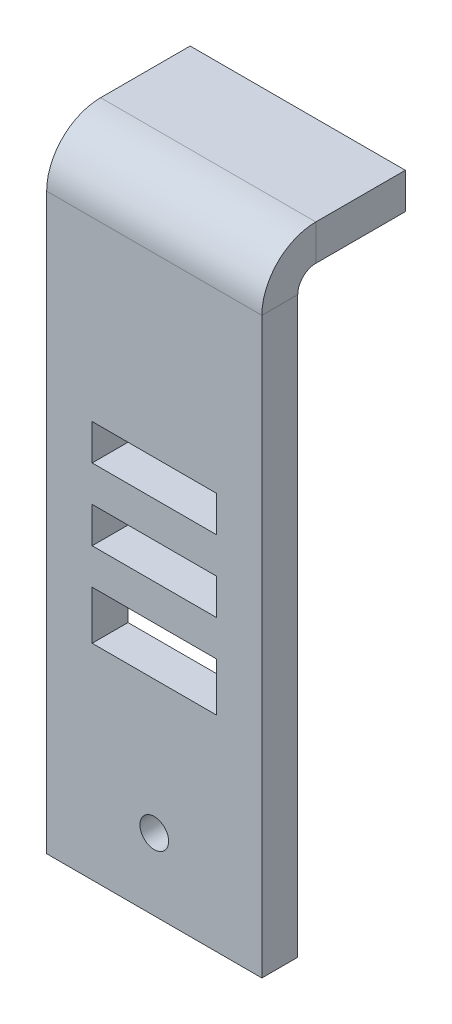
ISO-10303-21;
HEADER;
FILE_DESCRIPTION(('STEP AP214'),'2;1');
FILE_NAME('part.step','',(''),(''),'','','');
FILE_SCHEMA(('AUTOMOTIVE_DESIGN { 1 0 10303 214 1 1 1 1 }'));
ENDSEC;
DATA;
#1=APPLICATION_CONTEXT('core data for automotive mechanical design processes');
#2=APPLICATION_PROTOCOL_DEFINITION('international standard','automotive_design',2000,#1);
#3=PRODUCT_CONTEXT('',#1,'mechanical');
#4=PRODUCT('Part','Part','',(#3));
#5=PRODUCT_RELATED_PRODUCT_CATEGORY('part','',(#4));
#6=PRODUCT_DEFINITION_FORMATION('','',#4);
#7=PRODUCT_DEFINITION_CONTEXT('part definition',#1,'design');
#8=PRODUCT_DEFINITION('design','',#6,#7);
#9=PRODUCT_DEFINITION_SHAPE('','',#8);
#10=(LENGTH_UNIT() NAMED_UNIT(*) SI_UNIT(.MILLI.,.METRE.));
#11=(NAMED_UNIT(*) PLANE_ANGLE_UNIT() SI_UNIT($,.RADIAN.));
#12=(NAMED_UNIT(*) SI_UNIT($,.STERADIAN.) SOLID_ANGLE_UNIT());
#13=UNCERTAINTY_MEASURE_WITH_UNIT(LENGTH_MEASURE(1.E-05),#10,'distance_accuracy_value','');
#14=(GEOMETRIC_REPRESENTATION_CONTEXT(3) GLOBAL_UNCERTAINTY_ASSIGNED_CONTEXT((#13)) GLOBAL_UNIT_ASSIGNED_CONTEXT((#10,
#11,#12)) REPRESENTATION_CONTEXT('',''));
#15=CARTESIAN_POINT('',(0.,0.,0.));
#16=DIRECTION('',(0.,0.,1.));
#17=DIRECTION('',(1.,0.,0.));
#18=AXIS2_PLACEMENT_3D('',#15,#16,#17);
#19=CARTESIAN_POINT('',(8.45955391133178,22.143660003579,-3.175));
#20=DIRECTION('',(1.,0.,0.));
#21=DIRECTION('',(0.,1.,0.));
#22=AXIS2_PLACEMENT_3D('',#19,#20,#21);
#23=PLANE('',#22);
#24=DIRECTION('',(0.,1.,0.));
#25=VECTOR('',#24,1.);
#26=CARTESIAN_POINT('',(8.45955391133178,22.143660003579,-3.175));
#27=LINE('',#26,#25);
#28=CARTESIAN_POINT('',(8.45955391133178,-30.256539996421,-3.175));
#29=VERTEX_POINT('',#28);
#30=CARTESIAN_POINT('',(8.45955391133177,20.543460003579,-3.175));
#31=VERTEX_POINT('',#30);
#32=EDGE_CURVE('E335',#29,#31,#27,.T.);
#33=ORIENTED_EDGE('',*,*,#32,.T.);
#34=DIRECTION('',(0.,0.,1.));
#35=VECTOR('',#34,1.);
#36=CARTESIAN_POINT('',(8.45955391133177,20.543460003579,-3.175));
#37=LINE('',#36,#35);
#38=CARTESIAN_POINT('',(8.45955391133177,20.543460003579,0.));
#39=VERTEX_POINT('',#38);
#40=EDGE_CURVE('E313',#31,#39,#37,.T.);
#41=ORIENTED_EDGE('',*,*,#40,.T.);
#42=DIRECTION('',(0.,1.,0.));
#43=VECTOR('',#42,1.);
#44=CARTESIAN_POINT('',(8.45955391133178,22.143660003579,0.));
#45=LINE('',#44,#43);
#46=CARTESIAN_POINT('',(8.45955391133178,-30.256539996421,0.));
#47=VERTEX_POINT('',#46);
#48=EDGE_CURVE('E332',#47,#39,#45,.T.);
#49=ORIENTED_EDGE('',*,*,#48,.F.);
#50=DIRECTION('',(0.,0.,1.));
#51=VECTOR('',#50,1.);
#52=CARTESIAN_POINT('',(8.45955391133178,-30.256539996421,-3.175));
#53=LINE('',#52,#51);
#54=EDGE_CURVE('E11',#29,#47,#53,.T.);
#55=ORIENTED_EDGE('',*,*,#54,.F.);
#56=EDGE_LOOP('',(#33,#41,#49,#55));
#57=FACE_BOUND('',#56,.T.);
#58=ADVANCED_FACE('F32',(#57),#23,.T.);
#59=CARTESIAN_POINT('',(-10.5904460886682,-30.256539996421,-3.175));
#60=DIRECTION('',(0.,0.,1.));
#61=DIRECTION('',(1.,0.,0.));
#62=AXIS2_PLACEMENT_3D('',#59,#60,#61);
#63=PLANE('',#62);
#64=DIRECTION('',(-1.,0.,0.));
#65=VECTOR('',#64,1.);
#66=CARTESIAN_POINT('',(-10.5904460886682,4.89279983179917,-3.175));
#67=LINE('',#66,#65);
#68=CARTESIAN_POINT('',(4.433893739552,4.89279983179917,-3.175));
#69=VERTEX_POINT('',#68);
#70=CARTESIAN_POINT('',(-6.56478591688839,4.89279983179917,-3.175));
#71=VERTEX_POINT('',#70);
#72=EDGE_CURVE('E199',#69,#71,#67,.T.);
#73=ORIENTED_EDGE('',*,*,#72,.T.);
#74=DIRECTION('',(0.,-1.,0.));
#75=VECTOR('',#74,1.);
#76=CARTESIAN_POINT('',(-6.56478591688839,-30.256539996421,-3.175));
#77=LINE('',#76,#75);
#78=CARTESIAN_POINT('',(-6.56478591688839,1.71779983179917,-3.175));
#79=VERTEX_POINT('',#78);
#80=EDGE_CURVE('E202',#71,#79,#77,.T.);
#81=ORIENTED_EDGE('',*,*,#80,.T.);
#82=DIRECTION('',(1.,0.,0.));
#83=VECTOR('',#82,1.);
#84=CARTESIAN_POINT('',(-10.5904460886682,1.71779983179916,-3.175));
#85=LINE('',#84,#83);
#86=CARTESIAN_POINT('',(4.433893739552,1.71779983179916,-3.175));
#87=VERTEX_POINT('',#86);
#88=EDGE_CURVE('E194',#79,#87,#85,.T.);
#89=ORIENTED_EDGE('',*,*,#88,.T.);
#90=DIRECTION('',(0.,1.,0.));
#91=VECTOR('',#90,1.);
#92=CARTESIAN_POINT('',(4.433893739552,-30.256539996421,-3.175));
#93=LINE('',#92,#91);
#94=EDGE_CURVE('E174',#87,#69,#93,.T.);
#95=ORIENTED_EDGE('',*,*,#94,.T.);
#96=EDGE_LOOP('',(#73,#81,#89,#95));
#97=FACE_BOUND('',#96,.T.);
#98=DIRECTION('',(-1.,0.,0.));
#99=VECTOR('',#98,1.);
#100=CARTESIAN_POINT('',(-10.5904460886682,-1.45720016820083,-3.175));
#101=LINE('',#100,#99);
#102=CARTESIAN_POINT('',(4.433893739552,-1.45720016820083,-3.175));
#103=VERTEX_POINT('',#102);
#104=CARTESIAN_POINT('',(-6.56478591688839,-1.45720016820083,-3.175));
#105=VERTEX_POINT('',#104);
#106=EDGE_CURVE('E231',#103,#105,#101,.T.);
#107=ORIENTED_EDGE('',*,*,#106,.T.);
#108=DIRECTION('',(0.,-1.,0.));
#109=VECTOR('',#108,1.);
#110=CARTESIAN_POINT('',(-6.56478591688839,-30.256539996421,-3.175));
#111=LINE('',#110,#109);
#112=CARTESIAN_POINT('',(-6.56478591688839,-4.63220016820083,-3.175));
#113=VERTEX_POINT('',#112);
#114=EDGE_CURVE('E234',#105,#113,#111,.T.);
#115=ORIENTED_EDGE('',*,*,#114,.T.);
#116=DIRECTION('',(1.,0.,0.));
#117=VECTOR('',#116,1.);
#118=CARTESIAN_POINT('',(-10.5904460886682,-4.63220016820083,-3.175));
#119=LINE('',#118,#117);
#120=CARTESIAN_POINT('',(4.433893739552,-4.63220016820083,-3.175));
#121=VERTEX_POINT('',#120);
#122=EDGE_CURVE('E219',#113,#121,#119,.T.);
#123=ORIENTED_EDGE('',*,*,#122,.T.);
#124=DIRECTION('',(0.,1.,0.));
#125=VECTOR('',#124,1.);
#126=CARTESIAN_POINT('',(4.433893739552,-30.256539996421,-3.175));
#127=LINE('',#126,#125);
#128=EDGE_CURVE('E228',#121,#103,#127,.T.);
#129=ORIENTED_EDGE('',*,*,#128,.T.);
#130=EDGE_LOOP('',(#107,#115,#123,#129));
#131=FACE_BOUND('',#130,.T.);
#132=DIRECTION('',(0.,1.,0.));
#133=VECTOR('',#132,1.);
#134=CARTESIAN_POINT('',(4.43389373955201,-30.256539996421,-3.175));
#135=LINE('',#134,#133);
#136=CARTESIAN_POINT('',(4.433893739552,-12.106539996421,-3.175));
#137=VERTEX_POINT('',#136);
#138=CARTESIAN_POINT('',(4.433893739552,-7.80720016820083,-3.175));
#139=VERTEX_POINT('',#138);
#140=EDGE_CURVE('E263',#137,#139,#135,.T.);
#141=ORIENTED_EDGE('',*,*,#140,.T.);
#142=DIRECTION('',(-1.,0.,0.));
#143=VECTOR('',#142,1.);
#144=CARTESIAN_POINT('',(-10.5904460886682,-7.80720016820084,-3.175));
#145=LINE('',#144,#143);
#146=CARTESIAN_POINT('',(-6.56478591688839,-7.80720016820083,-3.175));
#147=VERTEX_POINT('',#146);
#148=EDGE_CURVE('E266',#139,#147,#145,.T.);
#149=ORIENTED_EDGE('',*,*,#148,.T.);
#150=DIRECTION('',(0.,-1.,0.));
#151=VECTOR('',#150,1.);
#152=CARTESIAN_POINT('',(-6.56478591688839,-30.256539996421,-3.175));
#153=LINE('',#152,#151);
#154=CARTESIAN_POINT('',(-6.56478591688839,-12.106539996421,-3.175));
#155=VERTEX_POINT('',#154);
#156=EDGE_CURVE('E251',#147,#155,#153,.T.);
#157=ORIENTED_EDGE('',*,*,#156,.T.);
#158=DIRECTION('',(1.,0.,0.));
#159=VECTOR('',#158,1.);
#160=CARTESIAN_POINT('',(-10.5904460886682,-12.106539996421,-3.175));
#161=LINE('',#160,#159);
#162=EDGE_CURVE('E260',#155,#137,#161,.T.);
#163=ORIENTED_EDGE('',*,*,#162,.T.);
#164=EDGE_LOOP('',(#141,#149,#157,#163));
#165=FACE_BOUND('',#164,.T.);
#166=CARTESIAN_POINT('',(-1.06544608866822,-23.906539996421,-3.175));
#167=DIRECTION('',(0.,0.,1.));
#168=DIRECTION('',(1.,0.,0.));
#169=AXIS2_PLACEMENT_3D('',#166,#167,#168);
#170=CIRCLE('',#169,1.27);
#171=CARTESIAN_POINT('',(0.204553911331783,-23.906539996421,-3.175));
#172=VERTEX_POINT('',#171);
#173=EDGE_CURVE('E272',#172,#172,#170,.T.);
#174=ORIENTED_EDGE('',*,*,#173,.T.);
#175=EDGE_LOOP('',(#174));
#176=FACE_BOUND('',#175,.T.);
#177=DIRECTION('',(1.,0.,0.));
#178=VECTOR('',#177,1.);
#179=CARTESIAN_POINT('',(8.45955391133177,20.543460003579,-3.175));
#180=LINE('',#179,#178);
#181=CARTESIAN_POINT('',(-10.5904460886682,20.543460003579,-3.175));
#182=VERTEX_POINT('',#181);
#183=EDGE_CURVE('E319',#31,#182,#180,.F.);
#184=ORIENTED_EDGE('',*,*,#183,.F.);
#185=ORIENTED_EDGE('',*,*,#32,.F.);
#186=DIRECTION('',(1.,0.,0.));
#187=VECTOR('',#186,1.);
#188=CARTESIAN_POINT('',(-10.5904460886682,-30.256539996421,-3.175));
#189=LINE('',#188,#187);
#190=CARTESIAN_POINT('',(-10.5904460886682,-30.256539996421,-3.175));
#191=VERTEX_POINT('',#190);
#192=EDGE_CURVE('E331',#191,#29,#189,.T.);
#193=ORIENTED_EDGE('',*,*,#192,.F.);
#194=DIRECTION('',(0.,-1.,0.));
#195=VECTOR('',#194,1.);
#196=CARTESIAN_POINT('',(-10.5904460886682,22.143660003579,-3.175));
#197=LINE('',#196,#195);
#198=EDGE_CURVE('E329',#182,#191,#197,.T.);
#199=ORIENTED_EDGE('',*,*,#198,.F.);
#200=EDGE_LOOP('',(#184,#185,#193,#199));
#201=FACE_BOUND('',#200,.T.);
#202=ADVANCED_FACE('F360',(#97,#131,#165,#176,#201),#63,.F.);
#203=CARTESIAN_POINT('',(-10.5904460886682,-30.256539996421,0.));
#204=DIRECTION('',(0.,0.,1.));
#205=DIRECTION('',(1.,0.,0.));
#206=AXIS2_PLACEMENT_3D('',#203,#204,#205);
#207=PLANE('',#206);
#208=DIRECTION('',(0.,-1.,0.));
#209=VECTOR('',#208,1.);
#210=CARTESIAN_POINT('',(-6.56478591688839,1.71779983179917,0.));
#211=LINE('',#210,#209);
#212=CARTESIAN_POINT('',(-6.56478591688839,4.89279983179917,0.));
#213=VERTEX_POINT('',#212);
#214=CARTESIAN_POINT('',(-6.56478591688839,1.71779983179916,0.));
#215=VERTEX_POINT('',#214);
#216=EDGE_CURVE('E55',#213,#215,#211,.T.);
#217=ORIENTED_EDGE('',*,*,#216,.F.);
#218=DIRECTION('',(-1.,0.,0.));
#219=VECTOR('',#218,1.);
#220=CARTESIAN_POINT('',(-6.56478591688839,4.89279983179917,0.));
#221=LINE('',#220,#219);
#222=CARTESIAN_POINT('',(4.433893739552,4.89279983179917,0.));
#223=VERTEX_POINT('',#222);
#224=EDGE_CURVE('E187',#223,#213,#221,.T.);
#225=ORIENTED_EDGE('',*,*,#224,.F.);
#226=DIRECTION('',(0.,1.,0.));
#227=VECTOR('',#226,1.);
#228=CARTESIAN_POINT('',(4.433893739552,1.71779983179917,0.));
#229=LINE('',#228,#227);
#230=CARTESIAN_POINT('',(4.433893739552,1.71779983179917,0.));
#231=VERTEX_POINT('',#230);
#232=EDGE_CURVE('E171',#231,#223,#229,.T.);
#233=ORIENTED_EDGE('',*,*,#232,.F.);
#234=DIRECTION('',(1.,0.,0.));
#235=VECTOR('',#234,1.);
#236=CARTESIAN_POINT('',(-6.56478591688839,1.71779983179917,0.));
#237=LINE('',#236,#235);
#238=EDGE_CURVE('E180',#215,#231,#237,.T.);
#239=ORIENTED_EDGE('',*,*,#238,.F.);
#240=EDGE_LOOP('',(#217,#225,#233,#239));
#241=FACE_BOUND('',#240,.T.);
#242=DIRECTION('',(0.,-1.,0.));
#243=VECTOR('',#242,1.);
#244=CARTESIAN_POINT('',(-6.56478591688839,-4.63220016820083,0.));
#245=LINE('',#244,#243);
#246=CARTESIAN_POINT('',(-6.56478591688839,-1.45720016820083,0.));
#247=VERTEX_POINT('',#246);
#248=CARTESIAN_POINT('',(-6.56478591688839,-4.63220016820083,0.));
#249=VERTEX_POINT('',#248);
#250=EDGE_CURVE('E205',#247,#249,#245,.T.);
#251=ORIENTED_EDGE('',*,*,#250,.F.);
#252=DIRECTION('',(-1.,0.,0.));
#253=VECTOR('',#252,1.);
#254=CARTESIAN_POINT('',(-6.56478591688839,-1.45720016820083,0.));
#255=LINE('',#254,#253);
#256=CARTESIAN_POINT('',(4.433893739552,-1.45720016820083,0.));
#257=VERTEX_POINT('',#256);
#258=EDGE_CURVE('E213',#257,#247,#255,.T.);
#259=ORIENTED_EDGE('',*,*,#258,.F.);
#260=DIRECTION('',(0.,1.,0.));
#261=VECTOR('',#260,1.);
#262=CARTESIAN_POINT('',(4.433893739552,-4.63220016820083,0.));
#263=LINE('',#262,#261);
#264=CARTESIAN_POINT('',(4.433893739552,-4.63220016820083,0.));
#265=VERTEX_POINT('',#264);
#266=EDGE_CURVE('E210',#265,#257,#263,.T.);
#267=ORIENTED_EDGE('',*,*,#266,.F.);
#268=DIRECTION('',(1.,0.,0.));
#269=VECTOR('',#268,1.);
#270=CARTESIAN_POINT('',(-6.56478591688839,-4.63220016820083,0.));
#271=LINE('',#270,#269);
#272=EDGE_CURVE('E207',#249,#265,#271,.T.);
#273=ORIENTED_EDGE('',*,*,#272,.F.);
#274=EDGE_LOOP('',(#251,#259,#267,#273));
#275=FACE_BOUND('',#274,.T.);
#276=DIRECTION('',(-1.,0.,0.));
#277=VECTOR('',#276,1.);
#278=CARTESIAN_POINT('',(-1.06544608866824,-7.80720016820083,0.));
#279=LINE('',#278,#277);
#280=CARTESIAN_POINT('',(4.433893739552,-7.80720016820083,0.));
#281=VERTEX_POINT('',#280);
#282=CARTESIAN_POINT('',(-6.56478591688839,-7.80720016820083,0.));
#283=VERTEX_POINT('',#282);
#284=EDGE_CURVE('E237',#281,#283,#279,.T.);
#285=ORIENTED_EDGE('',*,*,#284,.F.);
#286=DIRECTION('',(0.,1.,0.));
#287=VECTOR('',#286,1.);
#288=CARTESIAN_POINT('',(4.43389373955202,-47.1979994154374,0.));
#289=LINE('',#288,#287);
#290=CARTESIAN_POINT('',(4.433893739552,-12.106539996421,0.));
#291=VERTEX_POINT('',#290);
#292=EDGE_CURVE('E245',#291,#281,#289,.T.);
#293=ORIENTED_EDGE('',*,*,#292,.F.);
#294=DIRECTION('',(1.,0.,0.));
#295=VECTOR('',#294,1.);
#296=CARTESIAN_POINT('',(-1.06544608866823,-12.106539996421,0.));
#297=LINE('',#296,#295);
#298=CARTESIAN_POINT('',(-6.56478591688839,-12.106539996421,0.));
#299=VERTEX_POINT('',#298);
#300=EDGE_CURVE('E242',#299,#291,#297,.T.);
#301=ORIENTED_EDGE('',*,*,#300,.F.);
#302=DIRECTION('',(0.,-1.,0.));
#303=VECTOR('',#302,1.);
#304=CARTESIAN_POINT('',(-6.56478591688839,-47.1979994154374,0.));
#305=LINE('',#304,#303);
#306=EDGE_CURVE('E239',#283,#299,#305,.T.);
#307=ORIENTED_EDGE('',*,*,#306,.F.);
#308=EDGE_LOOP('',(#285,#293,#301,#307));
#309=FACE_BOUND('',#308,.T.);
#310=CARTESIAN_POINT('',(-1.06544608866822,-23.906539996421,0.));
#311=DIRECTION('',(0.,0.,1.));
#312=DIRECTION('',(1.,0.,0.));
#313=AXIS2_PLACEMENT_3D('',#310,#311,#312);
#314=CIRCLE('',#313,1.27);
#315=CARTESIAN_POINT('',(0.204553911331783,-23.906539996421,0.));
#316=VERTEX_POINT('',#315);
#317=EDGE_CURVE('E269',#316,#316,#314,.T.);
#318=ORIENTED_EDGE('',*,*,#317,.F.);
#319=EDGE_LOOP('',(#318));
#320=FACE_BOUND('',#319,.T.);
#321=ORIENTED_EDGE('',*,*,#48,.T.);
#322=DIRECTION('',(1.,0.,0.));
#323=VECTOR('',#322,1.);
#324=CARTESIAN_POINT('',(8.45955391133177,20.543460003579,0.));
#325=LINE('',#324,#323);
#326=CARTESIAN_POINT('',(-10.5904460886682,20.543460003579,0.));
#327=VERTEX_POINT('',#326);
#328=EDGE_CURVE('E306',#39,#327,#325,.F.);
#329=ORIENTED_EDGE('',*,*,#328,.T.);
#330=DIRECTION('',(0.,-1.,0.));
#331=VECTOR('',#330,1.);
#332=CARTESIAN_POINT('',(-10.5904460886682,22.143660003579,0.));
#333=LINE('',#332,#331);
#334=CARTESIAN_POINT('',(-10.5904460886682,-30.256539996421,0.));
#335=VERTEX_POINT('',#334);
#336=EDGE_CURVE('E326',#327,#335,#333,.T.);
#337=ORIENTED_EDGE('',*,*,#336,.T.);
#338=DIRECTION('',(1.,0.,0.));
#339=VECTOR('',#338,1.);
#340=CARTESIAN_POINT('',(-10.5904460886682,-30.256539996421,0.));
#341=LINE('',#340,#339);
#342=EDGE_CURVE('E339',#335,#47,#341,.T.);
#343=ORIENTED_EDGE('',*,*,#342,.T.);
#344=EDGE_LOOP('',(#321,#329,#337,#343));
#345=FACE_BOUND('',#344,.T.);
#346=ADVANCED_FACE('F184',(#241,#275,#309,#320,#345),#207,.T.);
#347=CARTESIAN_POINT('',(-10.5904460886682,22.143660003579,-3.175));
#348=DIRECTION('',(-1.,0.,0.));
#349=DIRECTION('',(0.,-1.,0.));
#350=AXIS2_PLACEMENT_3D('',#347,#348,#349);
#351=PLANE('',#350);
#352=DIRECTION('',(0.,0.,1.));
#353=VECTOR('',#352,1.);
#354=CARTESIAN_POINT('',(-10.5904460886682,20.543460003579,-3.175));
#355=LINE('',#354,#353);
#356=EDGE_CURVE('E323',#182,#327,#355,.T.);
#357=ORIENTED_EDGE('',*,*,#356,.F.);
#358=ORIENTED_EDGE('',*,*,#198,.T.);
#359=DIRECTION('',(0.,0.,1.));
#360=VECTOR('',#359,1.);
#361=CARTESIAN_POINT('',(-10.5904460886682,-30.256539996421,-3.175));
#362=LINE('',#361,#360);
#363=EDGE_CURVE('E36',#191,#335,#362,.T.);
#364=ORIENTED_EDGE('',*,*,#363,.T.);
#365=ORIENTED_EDGE('',*,*,#336,.F.);
#366=EDGE_LOOP('',(#357,#358,#364,#365));
#367=FACE_BOUND('',#366,.T.);
#368=ADVANCED_FACE('F34',(#367),#351,.T.);
#369=CARTESIAN_POINT('',(-10.5904460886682,-30.256539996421,-3.175));
#370=DIRECTION('',(0.,-1.,0.));
#371=DIRECTION('',(0.,0.,-1.));
#372=AXIS2_PLACEMENT_3D('',#369,#370,#371);
#373=PLANE('',#372);
#374=ORIENTED_EDGE('',*,*,#342,.F.);
#375=ORIENTED_EDGE('',*,*,#363,.F.);
#376=ORIENTED_EDGE('',*,*,#192,.T.);
#377=ORIENTED_EDGE('',*,*,#54,.T.);
#378=EDGE_LOOP('',(#374,#375,#376,#377));
#379=FACE_BOUND('',#378,.T.);
#380=ADVANCED_FACE('F367',(#379),#373,.T.);
#381=CARTESIAN_POINT('',(-10.5904460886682,20.543460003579,-4.7752));
#382=DIRECTION('',(-1.,0.,0.));
#383=DIRECTION('',(0.,0.,1.));
#384=AXIS2_PLACEMENT_3D('',#381,#382,#383);
#385=PLANE('',#384);
#386=DIRECTION('',(0.,1.,0.));
#387=VECTOR('',#386,1.);
#388=CARTESIAN_POINT('',(-10.5904460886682,22.143660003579,-4.7752));
#389=LINE('',#388,#387);
#390=CARTESIAN_POINT('',(-10.5904460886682,22.143660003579,-4.7752));
#391=VERTEX_POINT('',#390);
#392=CARTESIAN_POINT('',(-10.5904460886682,25.318660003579,-4.77519999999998));
#393=VERTEX_POINT('',#392);
#394=EDGE_CURVE('E275',#391,#393,#389,.T.);
#395=ORIENTED_EDGE('',*,*,#394,.F.);
#396=CARTESIAN_POINT('',(-10.5904460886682,20.543460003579,-4.7752));
#397=DIRECTION('',(1.,0.,0.));
#398=DIRECTION('',(0.,0.,-1.));
#399=AXIS2_PLACEMENT_3D('',#396,#397,#398);
#400=CIRCLE('',#399,1.6002);
#401=EDGE_CURVE('E316',#182,#391,#400,.F.);
#402=ORIENTED_EDGE('',*,*,#401,.F.);
#403=ORIENTED_EDGE('',*,*,#356,.T.);
#404=CARTESIAN_POINT('',(-10.5904460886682,20.543460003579,-4.7752));
#405=DIRECTION('',(1.,0.,0.));
#406=DIRECTION('',(0.,0.,-1.));
#407=AXIS2_PLACEMENT_3D('',#404,#405,#406);
#408=CIRCLE('',#407,4.7752);
#409=EDGE_CURVE('E309',#327,#393,#408,.F.);
#410=ORIENTED_EDGE('',*,*,#409,.T.);
#411=EDGE_LOOP('',(#395,#402,#403,#410));
#412=FACE_BOUND('',#411,.T.);
#413=ADVANCED_FACE('F369',(#412),#385,.T.);
#414=CARTESIAN_POINT('',(8.45955391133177,20.543460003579,-4.7752));
#415=DIRECTION('',(-1.,0.,0.));
#416=DIRECTION('',(0.,0.,1.));
#417=AXIS2_PLACEMENT_3D('',#414,#415,#416);
#418=PLANE('',#417);
#419=CARTESIAN_POINT('',(8.45955391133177,20.543460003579,-4.7752));
#420=DIRECTION('',(1.,0.,0.));
#421=DIRECTION('',(0.,0.,-1.));
#422=AXIS2_PLACEMENT_3D('',#419,#420,#421);
#423=CIRCLE('',#422,1.6002);
#424=CARTESIAN_POINT('',(8.45955391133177,22.143660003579,-4.7752));
#425=VERTEX_POINT('',#424);
#426=EDGE_CURVE('E305',#425,#31,#423,.T.);
#427=ORIENTED_EDGE('',*,*,#426,.F.);
#428=DIRECTION('',(0.,1.,0.));
#429=VECTOR('',#428,1.);
#430=CARTESIAN_POINT('',(8.45955391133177,22.143660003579,-4.7752));
#431=LINE('',#430,#429);
#432=CARTESIAN_POINT('',(8.45955391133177,25.318660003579,-4.77519999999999));
#433=VERTEX_POINT('',#432);
#434=EDGE_CURVE('E278',#425,#433,#431,.T.);
#435=ORIENTED_EDGE('',*,*,#434,.T.);
#436=CARTESIAN_POINT('',(8.45955391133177,20.543460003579,-4.7752));
#437=DIRECTION('',(1.,0.,0.));
#438=DIRECTION('',(0.,0.,-1.));
#439=AXIS2_PLACEMENT_3D('',#436,#437,#438);
#440=CIRCLE('',#439,4.7752);
#441=EDGE_CURVE('E310',#433,#39,#440,.T.);
#442=ORIENTED_EDGE('',*,*,#441,.T.);
#443=ORIENTED_EDGE('',*,*,#40,.F.);
#444=EDGE_LOOP('',(#427,#435,#442,#443));
#445=FACE_BOUND('',#444,.T.);
#446=ADVANCED_FACE('F351',(#445),#418,.F.);
#447=CARTESIAN_POINT('',(8.45955391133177,20.543460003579,-4.7752));
#448=DIRECTION('',(1.,0.,0.));
#449=DIRECTION('',(0.,1.,0.));
#450=AXIS2_PLACEMENT_3D('',#447,#448,#449);
#451=CYLINDRICAL_SURFACE('',#450,4.7752);
#452=ORIENTED_EDGE('',*,*,#328,.F.);
#453=ORIENTED_EDGE('',*,*,#441,.F.);
#454=DIRECTION('',(-1.,0.,0.));
#455=VECTOR('',#454,1.);
#456=CARTESIAN_POINT('',(8.45955391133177,25.318660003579,-4.77519999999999));
#457=LINE('',#456,#455);
#458=EDGE_CURVE('E281',#433,#393,#457,.T.);
#459=ORIENTED_EDGE('',*,*,#458,.T.);
#460=ORIENTED_EDGE('',*,*,#409,.F.);
#461=EDGE_LOOP('',(#452,#453,#459,#460));
#462=FACE_BOUND('',#461,.T.);
#463=ADVANCED_FACE('F376',(#462),#451,.T.);
#464=CARTESIAN_POINT('',(8.45955391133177,20.543460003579,-4.7752));
#465=DIRECTION('',(1.,0.,0.));
#466=DIRECTION('',(0.,1.,0.));
#467=AXIS2_PLACEMENT_3D('',#464,#465,#466);
#468=CYLINDRICAL_SURFACE('',#467,1.6002);
#469=ORIENTED_EDGE('',*,*,#183,.T.);
#470=ORIENTED_EDGE('',*,*,#401,.T.);
#471=DIRECTION('',(1.,0.,0.));
#472=VECTOR('',#471,1.);
#473=CARTESIAN_POINT('',(-10.5904460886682,22.143660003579,-4.7752));
#474=LINE('',#473,#472);
#475=EDGE_CURVE('E276',#391,#425,#474,.T.);
#476=ORIENTED_EDGE('',*,*,#475,.T.);
#477=ORIENTED_EDGE('',*,*,#426,.T.);
#478=EDGE_LOOP('',(#469,#470,#476,#477));
#479=FACE_BOUND('',#478,.T.);
#480=ADVANCED_FACE('F355',(#479),#468,.F.);
#481=CARTESIAN_POINT('',(8.45955391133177,25.318660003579,-12.7));
#482=DIRECTION('',(-1.,0.,0.));
#483=DIRECTION('',(0.,0.,1.));
#484=AXIS2_PLACEMENT_3D('',#481,#482,#483);
#485=PLANE('',#484);
#486=ORIENTED_EDGE('',*,*,#434,.F.);
#487=DIRECTION('',(0.,0.,-1.));
#488=VECTOR('',#487,1.);
#489=CARTESIAN_POINT('',(8.45955391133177,22.143660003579,-12.7));
#490=LINE('',#489,#488);
#491=CARTESIAN_POINT('',(8.45955391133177,22.143660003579,-12.7));
#492=VERTEX_POINT('',#491);
#493=EDGE_CURVE('E285',#425,#492,#490,.T.);
#494=ORIENTED_EDGE('',*,*,#493,.T.);
#495=DIRECTION('',(0.,-1.,0.));
#496=VECTOR('',#495,1.);
#497=CARTESIAN_POINT('',(8.45955391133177,25.318660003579,-12.7));
#498=LINE('',#497,#496);
#499=CARTESIAN_POINT('',(8.45955391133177,25.318660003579,-12.7));
#500=VERTEX_POINT('',#499);
#501=EDGE_CURVE('E302',#500,#492,#498,.T.);
#502=ORIENTED_EDGE('',*,*,#501,.F.);
#503=DIRECTION('',(0.,0.,-1.));
#504=VECTOR('',#503,1.);
#505=CARTESIAN_POINT('',(8.45955391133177,25.318660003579,-12.7));
#506=LINE('',#505,#504);
#507=EDGE_CURVE('E286',#433,#500,#506,.T.);
#508=ORIENTED_EDGE('',*,*,#507,.F.);
#509=EDGE_LOOP('',(#486,#494,#502,#508));
#510=FACE_BOUND('',#509,.T.);
#511=ADVANCED_FACE('F391',(#510),#485,.F.);
#512=CARTESIAN_POINT('',(-10.5904460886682,25.318660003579,-3.17499999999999));
#513=DIRECTION('',(1.,0.,0.));
#514=DIRECTION('',(0.,0.,-1.));
#515=AXIS2_PLACEMENT_3D('',#512,#513,#514);
#516=PLANE('',#515);
#517=ORIENTED_EDGE('',*,*,#394,.T.);
#518=DIRECTION('',(0.,0.,1.));
#519=VECTOR('',#518,1.);
#520=CARTESIAN_POINT('',(-10.5904460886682,25.318660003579,-3.17499999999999));
#521=LINE('',#520,#519);
#522=CARTESIAN_POINT('',(-10.5904460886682,25.318660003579,-12.7));
#523=VERTEX_POINT('',#522);
#524=EDGE_CURVE('E291',#523,#393,#521,.T.);
#525=ORIENTED_EDGE('',*,*,#524,.F.);
#526=DIRECTION('',(0.,-1.,0.));
#527=VECTOR('',#526,1.);
#528=CARTESIAN_POINT('',(-10.5904460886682,25.318660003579,-12.7));
#529=LINE('',#528,#527);
#530=CARTESIAN_POINT('',(-10.5904460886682,22.143660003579,-12.7));
#531=VERTEX_POINT('',#530);
#532=EDGE_CURVE('E294',#523,#531,#529,.T.);
#533=ORIENTED_EDGE('',*,*,#532,.T.);
#534=DIRECTION('',(0.,0.,1.));
#535=VECTOR('',#534,1.);
#536=CARTESIAN_POINT('',(-10.5904460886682,22.143660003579,-3.175));
#537=LINE('',#536,#535);
#538=EDGE_CURVE('E289',#531,#391,#537,.T.);
#539=ORIENTED_EDGE('',*,*,#538,.T.);
#540=EDGE_LOOP('',(#517,#525,#533,#539));
#541=FACE_BOUND('',#540,.T.);
#542=ADVANCED_FACE('F397',(#541),#516,.F.);
#543=CARTESIAN_POINT('',(8.45955391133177,25.318660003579,-3.17499999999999));
#544=DIRECTION('',(0.,-1.,0.));
#545=DIRECTION('',(0.,0.,-1.));
#546=AXIS2_PLACEMENT_3D('',#543,#544,#545);
#547=PLANE('',#546);
#548=ORIENTED_EDGE('',*,*,#458,.F.);
#549=ORIENTED_EDGE('',*,*,#507,.T.);
#550=DIRECTION('',(-1.,0.,0.));
#551=VECTOR('',#550,1.);
#552=CARTESIAN_POINT('',(-10.5904460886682,25.318660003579,-12.7));
#553=LINE('',#552,#551);
#554=EDGE_CURVE('E288',#500,#523,#553,.T.);
#555=ORIENTED_EDGE('',*,*,#554,.T.);
#556=ORIENTED_EDGE('',*,*,#524,.T.);
#557=EDGE_LOOP('',(#548,#549,#555,#556));
#558=FACE_BOUND('',#557,.T.);
#559=ADVANCED_FACE('F407',(#558),#547,.F.);
#560=CARTESIAN_POINT('',(8.45955391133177,22.143660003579,-3.175));
#561=DIRECTION('',(0.,-1.,0.));
#562=DIRECTION('',(0.,0.,-1.));
#563=AXIS2_PLACEMENT_3D('',#560,#561,#562);
#564=PLANE('',#563);
#565=ORIENTED_EDGE('',*,*,#493,.F.);
#566=ORIENTED_EDGE('',*,*,#475,.F.);
#567=ORIENTED_EDGE('',*,*,#538,.F.);
#568=DIRECTION('',(-1.,0.,0.));
#569=VECTOR('',#568,1.);
#570=CARTESIAN_POINT('',(-10.5904460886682,22.143660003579,-12.7));
#571=LINE('',#570,#569);
#572=EDGE_CURVE('E296',#492,#531,#571,.T.);
#573=ORIENTED_EDGE('',*,*,#572,.F.);
#574=EDGE_LOOP('',(#565,#566,#567,#573));
#575=FACE_BOUND('',#574,.T.);
#576=ADVANCED_FACE('F403',(#575),#564,.T.);
#577=CARTESIAN_POINT('',(-10.5904460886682,25.318660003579,-12.7));
#578=DIRECTION('',(0.,0.,1.));
#579=DIRECTION('',(0.,-1.,0.));
#580=AXIS2_PLACEMENT_3D('',#577,#578,#579);
#581=PLANE('',#580);
#582=ORIENTED_EDGE('',*,*,#572,.T.);
#583=ORIENTED_EDGE('',*,*,#532,.F.);
#584=ORIENTED_EDGE('',*,*,#554,.F.);
#585=ORIENTED_EDGE('',*,*,#501,.T.);
#586=EDGE_LOOP('',(#582,#583,#584,#585));
#587=FACE_BOUND('',#586,.T.);
#588=ADVANCED_FACE('F399',(#587),#581,.F.);
#589=CARTESIAN_POINT('',(-1.06544608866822,-23.906539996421,-12.7));
#590=DIRECTION('',(0.,0.,1.));
#591=DIRECTION('',(1.,0.,0.));
#592=AXIS2_PLACEMENT_3D('',#589,#590,#591);
#593=CYLINDRICAL_SURFACE('',#592,1.27);
#594=ORIENTED_EDGE('',*,*,#317,.T.);
#595=EDGE_LOOP('',(#594));
#596=FACE_BOUND('',#595,.T.);
#597=ORIENTED_EDGE('',*,*,#173,.F.);
#598=EDGE_LOOP('',(#597));
#599=FACE_BOUND('',#598,.T.);
#600=ADVANCED_FACE('F402',(#596,#599),#593,.F.);
#601=CARTESIAN_POINT('',(-1.06544608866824,-7.80720016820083,-12.7));
#602=DIRECTION('',(0.,1.,0.));
#603=DIRECTION('',(-1.,0.,0.));
#604=AXIS2_PLACEMENT_3D('',#601,#602,#603);
#605=PLANE('',#604);
#606=DIRECTION('',(0.,0.,1.));
#607=VECTOR('',#606,1.);
#608=CARTESIAN_POINT('',(4.433893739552,-7.80720016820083,-12.7));
#609=LINE('',#608,#607);
#610=EDGE_CURVE('E249',#139,#281,#609,.T.);
#611=ORIENTED_EDGE('',*,*,#610,.T.);
#612=ORIENTED_EDGE('',*,*,#284,.T.);
#613=DIRECTION('',(0.,0.,1.));
#614=VECTOR('',#613,1.);
#615=CARTESIAN_POINT('',(-6.56478591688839,-7.80720016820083,-12.7));
#616=LINE('',#615,#614);
#617=EDGE_CURVE('E248',#147,#283,#616,.T.);
#618=ORIENTED_EDGE('',*,*,#617,.F.);
#619=ORIENTED_EDGE('',*,*,#148,.F.);
#620=EDGE_LOOP('',(#611,#612,#618,#619));
#621=FACE_BOUND('',#620,.T.);
#622=ADVANCED_FACE('F417',(#621),#605,.F.);
#623=CARTESIAN_POINT('',(4.43389373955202,-47.1979994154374,-12.7));
#624=DIRECTION('',(1.,0.,0.));
#625=DIRECTION('',(0.,1.,0.));
#626=AXIS2_PLACEMENT_3D('',#623,#624,#625);
#627=PLANE('',#626);
#628=DIRECTION('',(0.,0.,1.));
#629=VECTOR('',#628,1.);
#630=CARTESIAN_POINT('',(4.433893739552,-12.106539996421,-12.7));
#631=LINE('',#630,#629);
#632=EDGE_CURVE('E252',#137,#291,#631,.T.);
#633=ORIENTED_EDGE('',*,*,#632,.T.);
#634=ORIENTED_EDGE('',*,*,#292,.T.);
#635=ORIENTED_EDGE('',*,*,#610,.F.);
#636=ORIENTED_EDGE('',*,*,#140,.F.);
#637=EDGE_LOOP('',(#633,#634,#635,#636));
#638=FACE_BOUND('',#637,.T.);
#639=ADVANCED_FACE('F421',(#638),#627,.F.);
#640=CARTESIAN_POINT('',(-1.06544608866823,-12.106539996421,-12.7));
#641=DIRECTION('',(0.,-1.,0.));
#642=DIRECTION('',(1.,0.,0.));
#643=AXIS2_PLACEMENT_3D('',#640,#641,#642);
#644=PLANE('',#643);
#645=DIRECTION('',(0.,0.,1.));
#646=VECTOR('',#645,1.);
#647=CARTESIAN_POINT('',(-6.56478591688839,-12.106539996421,-12.7));
#648=LINE('',#647,#646);
#649=EDGE_CURVE('E254',#155,#299,#648,.T.);
#650=ORIENTED_EDGE('',*,*,#649,.T.);
#651=ORIENTED_EDGE('',*,*,#300,.T.);
#652=ORIENTED_EDGE('',*,*,#632,.F.);
#653=ORIENTED_EDGE('',*,*,#162,.F.);
#654=EDGE_LOOP('',(#650,#651,#652,#653));
#655=FACE_BOUND('',#654,.T.);
#656=ADVANCED_FACE('F427',(#655),#644,.F.);
#657=CARTESIAN_POINT('',(-6.56478591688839,-47.1979994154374,-12.7));
#658=DIRECTION('',(-1.,0.,0.));
#659=DIRECTION('',(0.,0.,1.));
#660=AXIS2_PLACEMENT_3D('',#657,#658,#659);
#661=PLANE('',#660);
#662=ORIENTED_EDGE('',*,*,#617,.T.);
#663=ORIENTED_EDGE('',*,*,#306,.T.);
#664=ORIENTED_EDGE('',*,*,#649,.F.);
#665=ORIENTED_EDGE('',*,*,#156,.F.);
#666=EDGE_LOOP('',(#662,#663,#664,#665));
#667=FACE_BOUND('',#666,.T.);
#668=ADVANCED_FACE('F423',(#667),#661,.F.);
#669=CARTESIAN_POINT('',(-6.56478591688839,-4.63220016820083,-12.7));
#670=DIRECTION('',(-1.,0.,0.));
#671=DIRECTION('',(0.,0.,1.));
#672=AXIS2_PLACEMENT_3D('',#669,#670,#671);
#673=PLANE('',#672);
#674=DIRECTION('',(0.,0.,1.));
#675=VECTOR('',#674,1.);
#676=CARTESIAN_POINT('',(-6.56478591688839,-1.45720016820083,-12.7));
#677=LINE('',#676,#675);
#678=EDGE_CURVE('E217',#105,#247,#677,.T.);
#679=ORIENTED_EDGE('',*,*,#678,.T.);
#680=ORIENTED_EDGE('',*,*,#250,.T.);
#681=DIRECTION('',(0.,0.,1.));
#682=VECTOR('',#681,1.);
#683=CARTESIAN_POINT('',(-6.56478591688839,-4.63220016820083,-12.7));
#684=LINE('',#683,#682);
#685=EDGE_CURVE('E216',#113,#249,#684,.T.);
#686=ORIENTED_EDGE('',*,*,#685,.F.);
#687=ORIENTED_EDGE('',*,*,#114,.F.);
#688=EDGE_LOOP('',(#679,#680,#686,#687));
#689=FACE_BOUND('',#688,.T.);
#690=ADVANCED_FACE('F426',(#689),#673,.F.);
#691=CARTESIAN_POINT('',(-6.56478591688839,-1.45720016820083,-12.7));
#692=DIRECTION('',(0.,1.,0.));
#693=DIRECTION('',(0.,0.,1.));
#694=AXIS2_PLACEMENT_3D('',#691,#692,#693);
#695=PLANE('',#694);
#696=DIRECTION('',(0.,0.,1.));
#697=VECTOR('',#696,1.);
#698=CARTESIAN_POINT('',(4.433893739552,-1.45720016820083,-12.7));
#699=LINE('',#698,#697);
#700=EDGE_CURVE('E220',#103,#257,#699,.T.);
#701=ORIENTED_EDGE('',*,*,#700,.T.);
#702=ORIENTED_EDGE('',*,*,#258,.T.);
#703=ORIENTED_EDGE('',*,*,#678,.F.);
#704=ORIENTED_EDGE('',*,*,#106,.F.);
#705=EDGE_LOOP('',(#701,#702,#703,#704));
#706=FACE_BOUND('',#705,.T.);
#707=ADVANCED_FACE('F437',(#706),#695,.F.);
#708=CARTESIAN_POINT('',(4.433893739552,-4.63220016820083,-12.7));
#709=DIRECTION('',(1.,0.,0.));
#710=DIRECTION('',(0.,0.,-1.));
#711=AXIS2_PLACEMENT_3D('',#708,#709,#710);
#712=PLANE('',#711);
#713=DIRECTION('',(0.,0.,1.));
#714=VECTOR('',#713,1.);
#715=CARTESIAN_POINT('',(4.433893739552,-4.63220016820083,-12.7));
#716=LINE('',#715,#714);
#717=EDGE_CURVE('E222',#121,#265,#716,.T.);
#718=ORIENTED_EDGE('',*,*,#717,.T.);
#719=ORIENTED_EDGE('',*,*,#266,.T.);
#720=ORIENTED_EDGE('',*,*,#700,.F.);
#721=ORIENTED_EDGE('',*,*,#128,.F.);
#722=EDGE_LOOP('',(#718,#719,#720,#721));
#723=FACE_BOUND('',#722,.T.);
#724=ADVANCED_FACE('F443',(#723),#712,.F.);
#725=CARTESIAN_POINT('',(-6.56478591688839,-4.63220016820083,-12.7));
#726=DIRECTION('',(0.,-1.,0.));
#727=DIRECTION('',(0.,0.,-1.));
#728=AXIS2_PLACEMENT_3D('',#725,#726,#727);
#729=PLANE('',#728);
#730=ORIENTED_EDGE('',*,*,#685,.T.);
#731=ORIENTED_EDGE('',*,*,#272,.T.);
#732=ORIENTED_EDGE('',*,*,#717,.F.);
#733=ORIENTED_EDGE('',*,*,#122,.F.);
#734=EDGE_LOOP('',(#730,#731,#732,#733));
#735=FACE_BOUND('',#734,.T.);
#736=ADVANCED_FACE('F439',(#735),#729,.F.);
#737=CARTESIAN_POINT('',(-6.56478591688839,1.71779983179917,-12.7));
#738=DIRECTION('',(-1.,0.,0.));
#739=DIRECTION('',(0.,0.,1.));
#740=AXIS2_PLACEMENT_3D('',#737,#738,#739);
#741=PLANE('',#740);
#742=DIRECTION('',(0.,0.,1.));
#743=VECTOR('',#742,1.);
#744=CARTESIAN_POINT('',(-6.56478591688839,4.89279983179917,-12.7));
#745=LINE('',#744,#743);
#746=EDGE_CURVE('E192',#71,#213,#745,.T.);
#747=ORIENTED_EDGE('',*,*,#746,.T.);
#748=ORIENTED_EDGE('',*,*,#216,.T.);
#749=DIRECTION('',(0.,0.,1.));
#750=VECTOR('',#749,1.);
#751=CARTESIAN_POINT('',(-6.56478591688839,1.71779983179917,-12.7));
#752=LINE('',#751,#750);
#753=EDGE_CURVE('E177',#79,#215,#752,.T.);
#754=ORIENTED_EDGE('',*,*,#753,.F.);
#755=ORIENTED_EDGE('',*,*,#80,.F.);
#756=EDGE_LOOP('',(#747,#748,#754,#755));
#757=FACE_BOUND('',#756,.T.);
#758=ADVANCED_FACE('F442',(#757),#741,.F.);
#759=CARTESIAN_POINT('',(-6.56478591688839,4.89279983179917,-12.7));
#760=DIRECTION('',(0.,1.,0.));
#761=DIRECTION('',(0.,0.,1.));
#762=AXIS2_PLACEMENT_3D('',#759,#760,#761);
#763=PLANE('',#762);
#764=DIRECTION('',(0.,0.,1.));
#765=VECTOR('',#764,1.);
#766=CARTESIAN_POINT('',(4.433893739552,4.89279983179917,-12.7));
#767=LINE('',#766,#765);
#768=EDGE_CURVE('E176',#69,#223,#767,.T.);
#769=ORIENTED_EDGE('',*,*,#768,.T.);
#770=ORIENTED_EDGE('',*,*,#224,.T.);
#771=ORIENTED_EDGE('',*,*,#746,.F.);
#772=ORIENTED_EDGE('',*,*,#72,.F.);
#773=EDGE_LOOP('',(#769,#770,#771,#772));
#774=FACE_BOUND('',#773,.T.);
#775=ADVANCED_FACE('F453',(#774),#763,.F.);
#776=CARTESIAN_POINT('',(4.433893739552,1.71779983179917,-12.7));
#777=DIRECTION('',(1.,0.,0.));
#778=DIRECTION('',(0.,0.,-1.));
#779=AXIS2_PLACEMENT_3D('',#776,#777,#778);
#780=PLANE('',#779);
#781=DIRECTION('',(0.,0.,1.));
#782=VECTOR('',#781,1.);
#783=CARTESIAN_POINT('',(4.433893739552,1.71779983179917,-12.7));
#784=LINE('',#783,#782);
#785=EDGE_CURVE('E47',#87,#231,#784,.T.);
#786=ORIENTED_EDGE('',*,*,#785,.T.);
#787=ORIENTED_EDGE('',*,*,#232,.T.);
#788=ORIENTED_EDGE('',*,*,#768,.F.);
#789=ORIENTED_EDGE('',*,*,#94,.F.);
#790=EDGE_LOOP('',(#786,#787,#788,#789));
#791=FACE_BOUND('',#790,.T.);
#792=ADVANCED_FACE('F168',(#791),#780,.F.);
#793=CARTESIAN_POINT('',(-6.56478591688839,1.71779983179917,-12.7));
#794=DIRECTION('',(0.,-1.,0.));
#795=DIRECTION('',(0.,0.,-1.));
#796=AXIS2_PLACEMENT_3D('',#793,#794,#795);
#797=PLANE('',#796);
#798=ORIENTED_EDGE('',*,*,#753,.T.);
#799=ORIENTED_EDGE('',*,*,#238,.T.);
#800=ORIENTED_EDGE('',*,*,#785,.F.);
#801=ORIENTED_EDGE('',*,*,#88,.F.);
#802=EDGE_LOOP('',(#798,#799,#800,#801));
#803=FACE_BOUND('',#802,.T.);
#804=ADVANCED_FACE('F181',(#803),#797,.F.);
#805=CLOSED_SHELL('',(#58,#202,#346,#368,#380,#413,#446,#463,#480,#511,#542,#559,#576,#588,#600,
#622,#639,#656,#668,#690,#707,#724,#736,#758,#775,#792,#804));
#806=MANIFOLD_SOLID_BREP('B2',#805);
#807=ADVANCED_BREP_SHAPE_REPRESENTATION('',(#18,#806),#14);
#808=SHAPE_DEFINITION_REPRESENTATION(#9,#807);
ENDSEC;
END-ISO-10303-21;
